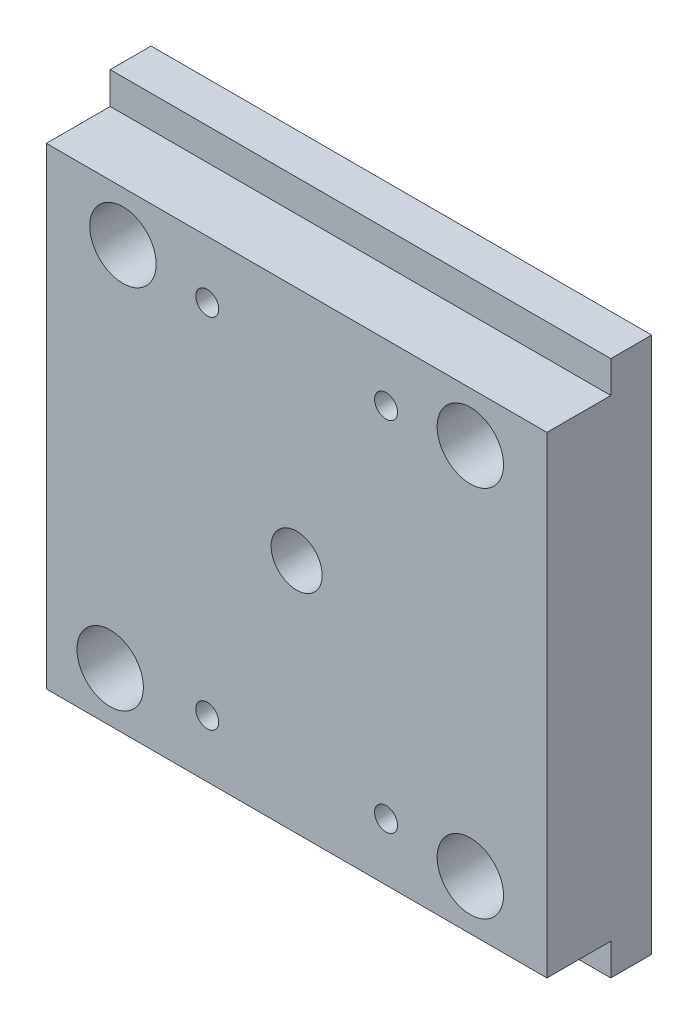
from build123d import *

# Parameters (mm, degrees)
ESQUISSE1_W                                        = 196
ESQUISSE1_H                                        = 210
EXTRUSION1_DEPTH                                   = 16
ESQUISSE2_W                                        = 196
ESQUISSE2_H                                        = 185
EXTRUSION2_DEPTH                                   = 25
ESQUISSE3_R                                        = 13
ESQUISSE3_R_2                                      = 10
ENL_V_MAT_EXTRU_1_DEPTH                            = 291.167193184
CHAMBRAGE_POUR_VIS_T_TE_HEXAGONALE_M81_D           = 9
CHAMBRAGE_POUR_VIS_T_TE_HEXAGONALE_M81_CBORE_D     = 15
CHAMBRAGE_POUR_VIS_T_TE_HEXAGONALE_M81_CBORE_DEPTH = 8


with BuildPart() as part:
    # Esquisse1 → Extrusion1 (new body)
    with BuildSketch(Plane.XY):
        with Locations((98, 105)):
            Rectangle(ESQUISSE1_W, ESQUISSE1_H)
    extrude(amount=EXTRUSION1_DEPTH)

    # Esquisse2 → Extrusion2 (add)
    with BuildSketch(Plane.XY.offset(16)):
        with Locations((98, 105)):
            Rectangle(ESQUISSE2_W, ESQUISSE2_H)
    extrude(amount=EXTRUSION2_DEPTH)

    # Esquisse3 → Enl_v. mat.-Extru.1 (cut, through all)
    with BuildSketch(Plane(origin=(0, 0, 0), x_dir=(-1, 0, 0), z_dir=(0, 0, -1))):
        with Locations((-30, 178)):
            Circle(ESQUISSE3_R)
        with Locations((-166, 178)):
            Circle(ESQUISSE3_R)
        with Locations((-166, 32)):
            Circle(ESQUISSE3_R)
        with Locations((-25, 32)):
            Circle(ESQUISSE3_R)
        with Locations((-98, 105)):
            Circle(ESQUISSE3_R_2)
    extrude(amount=-ENL_V_MAT_EXTRU_1_DEPTH, mode=Mode.SUBTRACT)

    # Chambrage pour vis _ t_te hexagonale M81 (through all)
    with Locations(Plane(origin=(0, 0, 0), x_dir=(-1, 0, 0), z_dir=(0, 0, -1))):
        with Locations((-63, 35), (-133, 35), (-133, 175), (-63, 175)):
            CounterBoreHole(CHAMBRAGE_POUR_VIS_T_TE_HEXAGONALE_M81_D / 2, CHAMBRAGE_POUR_VIS_T_TE_HEXAGONALE_M81_CBORE_D / 2, CHAMBRAGE_POUR_VIS_T_TE_HEXAGONALE_M81_CBORE_DEPTH)


solid = part.part
